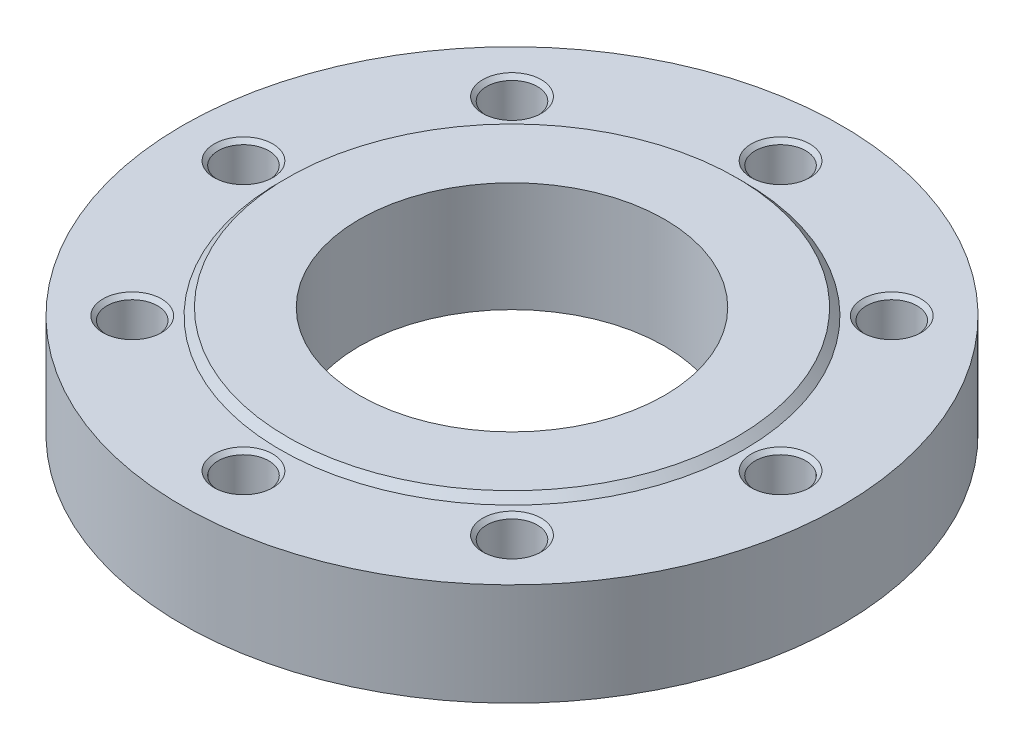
ISO-10303-21;
HEADER;
FILE_DESCRIPTION(('STEP AP214'),'2;1');
FILE_NAME('part.step','',(''),(''),'','','');
FILE_SCHEMA(('AUTOMOTIVE_DESIGN { 1 0 10303 214 1 1 1 1 }'));
ENDSEC;
DATA;
#1=APPLICATION_CONTEXT('core data for automotive mechanical design processes');
#2=APPLICATION_PROTOCOL_DEFINITION('international standard','automotive_design',2000,#1);
#3=PRODUCT_CONTEXT('',#1,'mechanical');
#4=PRODUCT('Part','Part','',(#3));
#5=PRODUCT_RELATED_PRODUCT_CATEGORY('part','',(#4));
#6=PRODUCT_DEFINITION_FORMATION('','',#4);
#7=PRODUCT_DEFINITION_CONTEXT('part definition',#1,'design');
#8=PRODUCT_DEFINITION('design','',#6,#7);
#9=PRODUCT_DEFINITION_SHAPE('','',#8);
#10=(LENGTH_UNIT() NAMED_UNIT(*) SI_UNIT(.MILLI.,.METRE.));
#11=(NAMED_UNIT(*) PLANE_ANGLE_UNIT() SI_UNIT($,.RADIAN.));
#12=(NAMED_UNIT(*) SI_UNIT($,.STERADIAN.) SOLID_ANGLE_UNIT());
#13=UNCERTAINTY_MEASURE_WITH_UNIT(LENGTH_MEASURE(1.E-05),#10,'distance_accuracy_value','');
#14=(GEOMETRIC_REPRESENTATION_CONTEXT(3) GLOBAL_UNCERTAINTY_ASSIGNED_CONTEXT((#13)) GLOBAL_UNIT_ASSIGNED_CONTEXT((#10,
#11,#12)) REPRESENTATION_CONTEXT('',''));
#15=CARTESIAN_POINT('',(0.,0.,0.));
#16=DIRECTION('',(0.,0.,1.));
#17=DIRECTION('',(1.,0.,0.));
#18=AXIS2_PLACEMENT_3D('',#15,#16,#17);
#19=CARTESIAN_POINT('',(0.,21.,0.));
#20=DIRECTION('',(0.,-1.,0.));
#21=DIRECTION('',(1.,0.,0.));
#22=AXIS2_PLACEMENT_3D('',#19,#20,#21);
#23=CYLINDRICAL_SURFACE('',#22,135.);
#24=CARTESIAN_POINT('',(0.,0.,0.));
#25=DIRECTION('',(0.,1.,0.));
#26=DIRECTION('',(1.,0.,0.));
#27=AXIS2_PLACEMENT_3D('',#24,#25,#26);
#28=CIRCLE('',#27,135.);
#29=CARTESIAN_POINT('',(135.,0.,0.));
#30=VERTEX_POINT('',#29);
#31=EDGE_CURVE('E9',#30,#30,#28,.T.);
#32=ORIENTED_EDGE('',*,*,#31,.T.);
#33=EDGE_LOOP('',(#32));
#34=FACE_BOUND('',#33,.T.);
#35=CARTESIAN_POINT('',(0.,42.,0.));
#36=DIRECTION('',(0.,1.,0.));
#37=DIRECTION('',(1.,0.,0.));
#38=AXIS2_PLACEMENT_3D('',#35,#36,#37);
#39=CIRCLE('',#38,135.);
#40=CARTESIAN_POINT('',(135.,42.,0.));
#41=VERTEX_POINT('',#40);
#42=EDGE_CURVE('E247',#41,#41,#39,.T.);
#43=ORIENTED_EDGE('',*,*,#42,.F.);
#44=EDGE_LOOP('',(#43));
#45=FACE_BOUND('',#44,.T.);
#46=ADVANCED_FACE('F15',(#34,#45),#23,.T.);
#47=CARTESIAN_POINT('',(98.75,0.,0.));
#48=DIRECTION('',(0.,-1.,0.));
#49=DIRECTION('',(-1.,0.,0.));
#50=AXIS2_PLACEMENT_3D('',#47,#48,#49);
#51=PLANE('',#50);
#52=CARTESIAN_POINT('',(0.,0.,0.));
#53=DIRECTION('',(0.,1.,0.));
#54=DIRECTION('',(1.,0.,0.));
#55=AXIS2_PLACEMENT_3D('',#52,#53,#54);
#56=CIRCLE('',#55,62.5);
#57=CARTESIAN_POINT('',(62.5,0.,0.));
#58=VERTEX_POINT('',#57);
#59=EDGE_CURVE('E22',#58,#58,#56,.T.);
#60=ORIENTED_EDGE('',*,*,#59,.T.);
#61=EDGE_LOOP('',(#60));
#62=FACE_BOUND('',#61,.T.);
#63=ORIENTED_EDGE('',*,*,#31,.F.);
#64=EDGE_LOOP('',(#63));
#65=FACE_BOUND('',#64,.T.);
#66=ADVANCED_FACE('F286',(#62,#65),#51,.T.);
#67=CARTESIAN_POINT('',(0.,22.5,0.));
#68=DIRECTION('',(0.,-1.,0.));
#69=DIRECTION('',(1.,0.,0.));
#70=AXIS2_PLACEMENT_3D('',#67,#68,#69);
#71=CYLINDRICAL_SURFACE('',#70,62.5);
#72=CARTESIAN_POINT('',(0.,45.,0.));
#73=DIRECTION('',(0.,1.,0.));
#74=DIRECTION('',(1.,0.,0.));
#75=AXIS2_PLACEMENT_3D('',#72,#73,#74);
#76=CIRCLE('',#75,62.5);
#77=CARTESIAN_POINT('',(62.5,45.,0.));
#78=VERTEX_POINT('',#77);
#79=EDGE_CURVE('E250',#78,#78,#76,.T.);
#80=ORIENTED_EDGE('',*,*,#79,.T.);
#81=EDGE_LOOP('',(#80));
#82=FACE_BOUND('',#81,.T.);
#83=ORIENTED_EDGE('',*,*,#59,.F.);
#84=EDGE_LOOP('',(#83));
#85=FACE_BOUND('',#84,.T.);
#86=ADVANCED_FACE('F290',(#82,#85),#71,.F.);
#87=CARTESIAN_POINT('',(77.25,45.,0.));
#88=DIRECTION('',(0.,1.,0.));
#89=DIRECTION('',(1.,0.,0.));
#90=AXIS2_PLACEMENT_3D('',#87,#88,#89);
#91=PLANE('',#90);
#92=CARTESIAN_POINT('',(0.,45.,0.));
#93=DIRECTION('',(0.,1.,0.));
#94=DIRECTION('',(1.,0.,0.));
#95=AXIS2_PLACEMENT_3D('',#92,#93,#94);
#96=CIRCLE('',#95,92.);
#97=CARTESIAN_POINT('',(92.,45.,0.));
#98=VERTEX_POINT('',#97);
#99=EDGE_CURVE('E249',#98,#98,#96,.T.);
#100=ORIENTED_EDGE('',*,*,#99,.T.);
#101=EDGE_LOOP('',(#100));
#102=FACE_BOUND('',#101,.T.);
#103=ORIENTED_EDGE('',*,*,#79,.F.);
#104=EDGE_LOOP('',(#103));
#105=FACE_BOUND('',#104,.T.);
#106=ADVANCED_FACE('F715',(#102,#105),#91,.T.);
#107=CARTESIAN_POINT('',(0.,43.5,0.));
#108=DIRECTION('',(0.,-1.,0.));
#109=DIRECTION('',(1.,0.,0.));
#110=AXIS2_PLACEMENT_3D('',#107,#108,#109);
#111=CONICAL_SURFACE('',#110,93.5,0.785398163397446);
#112=CARTESIAN_POINT('',(0.,42.,0.));
#113=DIRECTION('',(0.,1.,0.));
#114=DIRECTION('',(1.,0.,0.));
#115=AXIS2_PLACEMENT_3D('',#112,#113,#114);
#116=CIRCLE('',#115,95.);
#117=CARTESIAN_POINT('',(95.,42.,0.));
#118=VERTEX_POINT('',#117);
#119=EDGE_CURVE('E245',#118,#118,#116,.T.);
#120=ORIENTED_EDGE('',*,*,#119,.T.);
#121=EDGE_LOOP('',(#120));
#122=FACE_BOUND('',#121,.T.);
#123=ORIENTED_EDGE('',*,*,#99,.F.);
#124=EDGE_LOOP('',(#123));
#125=FACE_BOUND('',#124,.T.);
#126=ADVANCED_FACE('F298',(#122,#125),#111,.T.);
#127=CARTESIAN_POINT('',(115.,42.,0.));
#128=DIRECTION('',(0.,1.,0.));
#129=DIRECTION('',(1.,0.,0.));
#130=AXIS2_PLACEMENT_3D('',#127,#128,#129);
#131=PLANE('',#130);
#132=ORIENTED_EDGE('',*,*,#42,.T.);
#133=EDGE_LOOP('',(#132));
#134=FACE_BOUND('',#133,.T.);
#135=ORIENTED_EDGE('',*,*,#119,.F.);
#136=EDGE_LOOP('',(#135));
#137=FACE_BOUND('',#136,.T.);
#138=CARTESIAN_POINT('',(110.,42.,0.));
#139=DIRECTION('',(0.,-1.,0.));
#140=DIRECTION('',(1.,0.,0.));
#141=AXIS2_PLACEMENT_3D('',#138,#139,#140);
#142=CIRCLE('',#141,12.);
#143=CARTESIAN_POINT('',(122.,42.,0.));
#144=VERTEX_POINT('',#143);
#145=EDGE_CURVE('E235',#144,#144,#142,.T.);
#146=ORIENTED_EDGE('',*,*,#145,.T.);
#147=EDGE_LOOP('',(#146));
#148=FACE_BOUND('',#147,.T.);
#149=CARTESIAN_POINT('',(77.7817459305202,42.,-77.7817459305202));
#150=DIRECTION('',(0.,-1.,0.));
#151=DIRECTION('',(0.707106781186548,0.,-0.707106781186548));
#152=AXIS2_PLACEMENT_3D('',#149,#150,#151);
#153=CIRCLE('',#152,12.);
#154=CARTESIAN_POINT('',(86.2670273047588,42.,-86.2670273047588));
#155=VERTEX_POINT('',#154);
#156=EDGE_CURVE('E217',#155,#155,#153,.T.);
#157=ORIENTED_EDGE('',*,*,#156,.T.);
#158=EDGE_LOOP('',(#157));
#159=FACE_BOUND('',#158,.T.);
#160=CARTESIAN_POINT('',(0.,42.,-110.));
#161=DIRECTION('',(0.,-1.,0.));
#162=DIRECTION('',(0.,0.,-1.));
#163=AXIS2_PLACEMENT_3D('',#160,#161,#162);
#164=CIRCLE('',#163,12.);
#165=CARTESIAN_POINT('',(0.,42.,-122.));
#166=VERTEX_POINT('',#165);
#167=EDGE_CURVE('E262',#166,#166,#164,.T.);
#168=ORIENTED_EDGE('',*,*,#167,.T.);
#169=EDGE_LOOP('',(#168));
#170=FACE_BOUND('',#169,.T.);
#171=CARTESIAN_POINT('',(-77.7817459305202,42.,-77.7817459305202));
#172=DIRECTION('',(0.,-1.,0.));
#173=DIRECTION('',(-0.707106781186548,0.,-0.707106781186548));
#174=AXIS2_PLACEMENT_3D('',#171,#172,#173);
#175=CIRCLE('',#174,12.);
#176=CARTESIAN_POINT('',(-86.2670273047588,42.,-86.2670273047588));
#177=VERTEX_POINT('',#176);
#178=EDGE_CURVE('E310',#177,#177,#175,.T.);
#179=ORIENTED_EDGE('',*,*,#178,.T.);
#180=EDGE_LOOP('',(#179));
#181=FACE_BOUND('',#180,.T.);
#182=CARTESIAN_POINT('',(-110.,42.,0.));
#183=DIRECTION('',(0.,-1.,0.));
#184=DIRECTION('',(-1.,0.,0.));
#185=AXIS2_PLACEMENT_3D('',#182,#183,#184);
#186=CIRCLE('',#185,12.);
#187=CARTESIAN_POINT('',(-122.,42.,0.));
#188=VERTEX_POINT('',#187);
#189=EDGE_CURVE('E313',#188,#188,#186,.T.);
#190=ORIENTED_EDGE('',*,*,#189,.T.);
#191=EDGE_LOOP('',(#190));
#192=FACE_BOUND('',#191,.T.);
#193=CARTESIAN_POINT('',(-77.7817459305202,42.,77.7817459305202));
#194=DIRECTION('',(0.,-1.,0.));
#195=DIRECTION('',(-0.707106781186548,0.,0.707106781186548));
#196=AXIS2_PLACEMENT_3D('',#193,#194,#195);
#197=CIRCLE('',#196,12.);
#198=CARTESIAN_POINT('',(-86.2670273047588,42.,86.2670273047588));
#199=VERTEX_POINT('',#198);
#200=EDGE_CURVE('E316',#199,#199,#197,.T.);
#201=ORIENTED_EDGE('',*,*,#200,.T.);
#202=EDGE_LOOP('',(#201));
#203=FACE_BOUND('',#202,.T.);
#204=CARTESIAN_POINT('',(0.,42.,110.));
#205=DIRECTION('',(0.,-1.,0.));
#206=DIRECTION('',(0.,0.,1.));
#207=AXIS2_PLACEMENT_3D('',#204,#205,#206);
#208=CIRCLE('',#207,12.);
#209=CARTESIAN_POINT('',(0.,42.,122.));
#210=VERTEX_POINT('',#209);
#211=EDGE_CURVE('E319',#210,#210,#208,.T.);
#212=ORIENTED_EDGE('',*,*,#211,.T.);
#213=EDGE_LOOP('',(#212));
#214=FACE_BOUND('',#213,.T.);
#215=CARTESIAN_POINT('',(77.7817459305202,42.,77.7817459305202));
#216=DIRECTION('',(0.,-1.,0.));
#217=DIRECTION('',(0.707106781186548,0.,0.707106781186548));
#218=AXIS2_PLACEMENT_3D('',#215,#216,#217);
#219=CIRCLE('',#218,12.);
#220=CARTESIAN_POINT('',(86.2670273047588,42.,86.2670273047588));
#221=VERTEX_POINT('',#220);
#222=EDGE_CURVE('E321',#221,#221,#219,.T.);
#223=ORIENTED_EDGE('',*,*,#222,.T.);
#224=EDGE_LOOP('',(#223));
#225=FACE_BOUND('',#224,.T.);
#226=ADVANCED_FACE('F294',(#134,#137,#148,#159,#170,#181,#192,#203,#214,#225),#131,.T.);
#227=CARTESIAN_POINT('',(110.,6.00463463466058,0.));
#228=DIRECTION('',(0.,1.,0.));
#229=DIRECTION('',(1.,0.,0.));
#230=AXIS2_PLACEMENT_3D('',#227,#228,#229);
#231=CONICAL_SURFACE('',#230,5.188125,1.0471975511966);
#232=CARTESIAN_POINT('',(110.,9.,0.));
#233=DIRECTION('',(0.,-1.,0.));
#234=DIRECTION('',(1.,0.,0.));
#235=AXIS2_PLACEMENT_3D('',#232,#233,#234);
#236=CIRCLE('',#235,10.37625);
#237=CARTESIAN_POINT('',(120.37625,9.,0.));
#238=VERTEX_POINT('',#237);
#239=EDGE_CURVE('E243',#238,#238,#236,.T.);
#240=ORIENTED_EDGE('',*,*,#239,.F.);
#241=EDGE_LOOP('',(#240));
#242=FACE_BOUND('',#241,.T.);
#243=CARTESIAN_POINT('',(110.,3.00926926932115,0.));
#244=VERTEX_POINT('',#243);
#245=VERTEX_LOOP('',#244);
#246=FACE_BOUND('',#245,.T.);
#247=ADVANCED_FACE('F297',(#242,#246),#231,.F.);
#248=CARTESIAN_POINT('',(110.,12.688125,0.));
#249=DIRECTION('',(0.,1.,0.));
#250=DIRECTION('',(1.,0.,0.));
#251=AXIS2_PLACEMENT_3D('',#248,#249,#250);
#252=CYLINDRICAL_SURFACE('',#251,10.37625);
#253=CARTESIAN_POINT('',(110.,16.37625,0.));
#254=DIRECTION('',(0.,-1.,0.));
#255=DIRECTION('',(1.,0.,0.));
#256=AXIS2_PLACEMENT_3D('',#253,#254,#255);
#257=CIRCLE('',#256,10.37625);
#258=CARTESIAN_POINT('',(120.37625,16.37625,0.));
#259=VERTEX_POINT('',#258);
#260=EDGE_CURVE('E241',#259,#259,#257,.T.);
#261=ORIENTED_EDGE('',*,*,#260,.F.);
#262=EDGE_LOOP('',(#261));
#263=FACE_BOUND('',#262,.T.);
#264=ORIENTED_EDGE('',*,*,#239,.T.);
#265=EDGE_LOOP('',(#264));
#266=FACE_BOUND('',#265,.T.);
#267=ADVANCED_FACE('F731',(#263,#266),#252,.F.);
#268=CARTESIAN_POINT('',(110.,17.188125,0.));
#269=DIRECTION('',(0.,1.,0.));
#270=DIRECTION('',(1.,0.,0.));
#271=AXIS2_PLACEMENT_3D('',#268,#269,#270);
#272=CONICAL_SURFACE('',#271,11.188125,0.785398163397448);
#273=CARTESIAN_POINT('',(110.,18.,0.));
#274=DIRECTION('',(0.,-1.,0.));
#275=DIRECTION('',(1.,0.,0.));
#276=AXIS2_PLACEMENT_3D('',#273,#274,#275);
#277=CIRCLE('',#276,12.);
#278=CARTESIAN_POINT('',(122.,18.,0.));
#279=VERTEX_POINT('',#278);
#280=EDGE_CURVE('E239',#279,#279,#277,.T.);
#281=ORIENTED_EDGE('',*,*,#280,.F.);
#282=EDGE_LOOP('',(#281));
#283=FACE_BOUND('',#282,.T.);
#284=ORIENTED_EDGE('',*,*,#260,.T.);
#285=EDGE_LOOP('',(#284));
#286=FACE_BOUND('',#285,.T.);
#287=ADVANCED_FACE('F735',(#283,#286),#272,.F.);
#288=CARTESIAN_POINT('',(121.188125,18.,0.));
#289=DIRECTION('',(0.,1.,0.));
#290=DIRECTION('',(-1.,0.,0.));
#291=AXIS2_PLACEMENT_3D('',#288,#289,#290);
#292=PLANE('',#291);
#293=CARTESIAN_POINT('',(110.,18.,0.));
#294=DIRECTION('',(0.,-1.,0.));
#295=DIRECTION('',(1.,0.,0.));
#296=AXIS2_PLACEMENT_3D('',#293,#294,#295);
#297=CIRCLE('',#296,10.37625);
#298=CARTESIAN_POINT('',(120.37625,18.,0.));
#299=VERTEX_POINT('',#298);
#300=EDGE_CURVE('E237',#299,#299,#297,.T.);
#301=ORIENTED_EDGE('',*,*,#300,.F.);
#302=EDGE_LOOP('',(#301));
#303=FACE_BOUND('',#302,.T.);
#304=ORIENTED_EDGE('',*,*,#280,.T.);
#305=EDGE_LOOP('',(#304));
#306=FACE_BOUND('',#305,.T.);
#307=ADVANCED_FACE('F739',(#303,#306),#292,.F.);
#308=CARTESIAN_POINT('',(110.,29.188125,0.));
#309=DIRECTION('',(0.,1.,0.));
#310=DIRECTION('',(1.,0.,0.));
#311=AXIS2_PLACEMENT_3D('',#308,#309,#310);
#312=CYLINDRICAL_SURFACE('',#311,10.37625);
#313=CARTESIAN_POINT('',(110.,40.37625,0.));
#314=DIRECTION('',(0.,-1.,0.));
#315=DIRECTION('',(1.,0.,0.));
#316=AXIS2_PLACEMENT_3D('',#313,#314,#315);
#317=CIRCLE('',#316,10.37625);
#318=CARTESIAN_POINT('',(120.37625,40.37625,0.));
#319=VERTEX_POINT('',#318);
#320=EDGE_CURVE('E233',#319,#319,#317,.T.);
#321=ORIENTED_EDGE('',*,*,#320,.F.);
#322=EDGE_LOOP('',(#321));
#323=FACE_BOUND('',#322,.T.);
#324=ORIENTED_EDGE('',*,*,#300,.T.);
#325=EDGE_LOOP('',(#324));
#326=FACE_BOUND('',#325,.T.);
#327=ADVANCED_FACE('F743',(#323,#326),#312,.F.);
#328=CARTESIAN_POINT('',(110.,41.188125,0.));
#329=DIRECTION('',(0.,1.,0.));
#330=DIRECTION('',(1.,0.,0.));
#331=AXIS2_PLACEMENT_3D('',#328,#329,#330);
#332=CONICAL_SURFACE('',#331,11.188125,0.785398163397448);
#333=ORIENTED_EDGE('',*,*,#145,.F.);
#334=EDGE_LOOP('',(#333));
#335=FACE_BOUND('',#334,.T.);
#336=ORIENTED_EDGE('',*,*,#320,.T.);
#337=EDGE_LOOP('',(#336));
#338=FACE_BOUND('',#337,.T.);
#339=ADVANCED_FACE('F747',(#335,#338),#332,.F.);
#340=CARTESIAN_POINT('',(77.7817459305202,6.00463463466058,-77.7817459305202));
#341=DIRECTION('',(0.,1.,0.));
#342=DIRECTION('',(0.707106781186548,0.,-0.707106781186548));
#343=AXIS2_PLACEMENT_3D('',#340,#341,#342);
#344=CONICAL_SURFACE('',#343,5.188125,1.0471975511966);
#345=CARTESIAN_POINT('',(77.7817459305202,9.,-77.7817459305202));
#346=DIRECTION('',(0.,-1.,0.));
#347=DIRECTION('',(0.707106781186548,0.,-0.707106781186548));
#348=AXIS2_PLACEMENT_3D('',#345,#346,#347);
#349=CIRCLE('',#348,10.37625);
#350=CARTESIAN_POINT('',(85.1188626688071,9.,-85.1188626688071));
#351=VERTEX_POINT('',#350);
#352=EDGE_CURVE('E231',#351,#351,#349,.T.);
#353=ORIENTED_EDGE('',*,*,#352,.F.);
#354=EDGE_LOOP('',(#353));
#355=FACE_BOUND('',#354,.T.);
#356=CARTESIAN_POINT('',(77.7817459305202,3.00926926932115,-77.7817459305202));
#357=VERTEX_POINT('',#356);
#358=VERTEX_LOOP('',#357);
#359=FACE_BOUND('',#358,.T.);
#360=ADVANCED_FACE('F751',(#355,#359),#344,.F.);
#361=CARTESIAN_POINT('',(77.7817459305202,12.688125,-77.7817459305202));
#362=DIRECTION('',(0.,1.,0.));
#363=DIRECTION('',(0.707106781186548,0.,-0.707106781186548));
#364=AXIS2_PLACEMENT_3D('',#361,#362,#363);
#365=CYLINDRICAL_SURFACE('',#364,10.37625);
#366=CARTESIAN_POINT('',(77.7817459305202,16.37625,-77.7817459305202));
#367=DIRECTION('',(0.,-1.,0.));
#368=DIRECTION('',(0.707106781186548,0.,-0.707106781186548));
#369=AXIS2_PLACEMENT_3D('',#366,#367,#368);
#370=CIRCLE('',#369,10.37625);
#371=CARTESIAN_POINT('',(85.1188626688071,16.37625,-85.1188626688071));
#372=VERTEX_POINT('',#371);
#373=EDGE_CURVE('E229',#372,#372,#370,.T.);
#374=ORIENTED_EDGE('',*,*,#373,.F.);
#375=EDGE_LOOP('',(#374));
#376=FACE_BOUND('',#375,.T.);
#377=ORIENTED_EDGE('',*,*,#352,.T.);
#378=EDGE_LOOP('',(#377));
#379=FACE_BOUND('',#378,.T.);
#380=ADVANCED_FACE('F755',(#376,#379),#365,.F.);
#381=CARTESIAN_POINT('',(77.7817459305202,17.188125,-77.7817459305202));
#382=DIRECTION('',(0.,1.,0.));
#383=DIRECTION('',(0.707106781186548,0.,-0.707106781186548));
#384=AXIS2_PLACEMENT_3D('',#381,#382,#383);
#385=CONICAL_SURFACE('',#384,11.188125,0.785398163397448);
#386=CARTESIAN_POINT('',(77.7817459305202,18.,-77.7817459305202));
#387=DIRECTION('',(0.,-1.,0.));
#388=DIRECTION('',(0.707106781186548,0.,-0.707106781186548));
#389=AXIS2_PLACEMENT_3D('',#386,#387,#388);
#390=CIRCLE('',#389,12.);
#391=CARTESIAN_POINT('',(86.2670273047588,18.,-86.2670273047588));
#392=VERTEX_POINT('',#391);
#393=EDGE_CURVE('E227',#392,#392,#390,.T.);
#394=ORIENTED_EDGE('',*,*,#393,.F.);
#395=EDGE_LOOP('',(#394));
#396=FACE_BOUND('',#395,.T.);
#397=ORIENTED_EDGE('',*,*,#373,.T.);
#398=EDGE_LOOP('',(#397));
#399=FACE_BOUND('',#398,.T.);
#400=ADVANCED_FACE('F759',(#396,#399),#385,.F.);
#401=CARTESIAN_POINT('',(85.692944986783,18.,-85.692944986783));
#402=DIRECTION('',(0.,1.,0.));
#403=DIRECTION('',(-0.707106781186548,0.,0.707106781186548));
#404=AXIS2_PLACEMENT_3D('',#401,#402,#403);
#405=PLANE('',#404);
#406=CARTESIAN_POINT('',(77.7817459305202,18.,-77.7817459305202));
#407=DIRECTION('',(0.,-1.,0.));
#408=DIRECTION('',(0.707106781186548,0.,-0.707106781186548));
#409=AXIS2_PLACEMENT_3D('',#406,#407,#408);
#410=CIRCLE('',#409,10.37625);
#411=CARTESIAN_POINT('',(85.1188626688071,18.,-85.1188626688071));
#412=VERTEX_POINT('',#411);
#413=EDGE_CURVE('E225',#412,#412,#410,.T.);
#414=ORIENTED_EDGE('',*,*,#413,.F.);
#415=EDGE_LOOP('',(#414));
#416=FACE_BOUND('',#415,.T.);
#417=ORIENTED_EDGE('',*,*,#393,.T.);
#418=EDGE_LOOP('',(#417));
#419=FACE_BOUND('',#418,.T.);
#420=ADVANCED_FACE('F763',(#416,#419),#405,.F.);
#421=CARTESIAN_POINT('',(77.7817459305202,29.188125,-77.7817459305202));
#422=DIRECTION('',(0.,1.,0.));
#423=DIRECTION('',(0.707106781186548,0.,-0.707106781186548));
#424=AXIS2_PLACEMENT_3D('',#421,#422,#423);
#425=CYLINDRICAL_SURFACE('',#424,10.37625);
#426=CARTESIAN_POINT('',(77.7817459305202,40.37625,-77.7817459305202));
#427=DIRECTION('',(0.,-1.,0.));
#428=DIRECTION('',(0.707106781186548,0.,-0.707106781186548));
#429=AXIS2_PLACEMENT_3D('',#426,#427,#428);
#430=CIRCLE('',#429,10.37625);
#431=CARTESIAN_POINT('',(85.1188626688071,40.37625,-85.1188626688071));
#432=VERTEX_POINT('',#431);
#433=EDGE_CURVE('E214',#432,#432,#430,.T.);
#434=ORIENTED_EDGE('',*,*,#433,.F.);
#435=EDGE_LOOP('',(#434));
#436=FACE_BOUND('',#435,.T.);
#437=ORIENTED_EDGE('',*,*,#413,.T.);
#438=EDGE_LOOP('',(#437));
#439=FACE_BOUND('',#438,.T.);
#440=ADVANCED_FACE('F767',(#436,#439),#425,.F.);
#441=CARTESIAN_POINT('',(77.7817459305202,41.188125,-77.7817459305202));
#442=DIRECTION('',(0.,1.,0.));
#443=DIRECTION('',(0.707106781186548,0.,-0.707106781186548));
#444=AXIS2_PLACEMENT_3D('',#441,#442,#443);
#445=CONICAL_SURFACE('',#444,11.188125,0.785398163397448);
#446=ORIENTED_EDGE('',*,*,#156,.F.);
#447=EDGE_LOOP('',(#446));
#448=FACE_BOUND('',#447,.T.);
#449=ORIENTED_EDGE('',*,*,#433,.T.);
#450=EDGE_LOOP('',(#449));
#451=FACE_BOUND('',#450,.T.);
#452=ADVANCED_FACE('F283',(#448,#451),#445,.F.);
#453=CARTESIAN_POINT('',(0.,6.00463463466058,-110.));
#454=DIRECTION('',(0.,1.,0.));
#455=DIRECTION('',(0.,0.,-1.));
#456=AXIS2_PLACEMENT_3D('',#453,#454,#455);
#457=CONICAL_SURFACE('',#456,5.188125,1.0471975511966);
#458=CARTESIAN_POINT('',(0.,9.,-110.));
#459=DIRECTION('',(0.,-1.,0.));
#460=DIRECTION('',(0.,0.,-1.));
#461=AXIS2_PLACEMENT_3D('',#458,#459,#460);
#462=CIRCLE('',#461,10.37625);
#463=CARTESIAN_POINT('',(0.,9.,-120.37625));
#464=VERTEX_POINT('',#463);
#465=EDGE_CURVE('E211',#464,#464,#462,.T.);
#466=ORIENTED_EDGE('',*,*,#465,.F.);
#467=EDGE_LOOP('',(#466));
#468=FACE_BOUND('',#467,.T.);
#469=CARTESIAN_POINT('',(0.,3.00926926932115,-110.));
#470=VERTEX_POINT('',#469);
#471=VERTEX_LOOP('',#470);
#472=FACE_BOUND('',#471,.T.);
#473=ADVANCED_FACE('F277',(#468,#472),#457,.F.);
#474=CARTESIAN_POINT('',(0.,12.688125,-110.));
#475=DIRECTION('',(0.,1.,0.));
#476=DIRECTION('',(0.,0.,-1.));
#477=AXIS2_PLACEMENT_3D('',#474,#475,#476);
#478=CYLINDRICAL_SURFACE('',#477,10.37625);
#479=CARTESIAN_POINT('',(0.,16.37625,-110.));
#480=DIRECTION('',(0.,-1.,0.));
#481=DIRECTION('',(0.,0.,-1.));
#482=AXIS2_PLACEMENT_3D('',#479,#480,#481);
#483=CIRCLE('',#482,10.37625);
#484=CARTESIAN_POINT('',(0.,16.37625,-120.37625));
#485=VERTEX_POINT('',#484);
#486=EDGE_CURVE('E215',#485,#485,#483,.T.);
#487=ORIENTED_EDGE('',*,*,#486,.F.);
#488=EDGE_LOOP('',(#487));
#489=FACE_BOUND('',#488,.T.);
#490=ORIENTED_EDGE('',*,*,#465,.T.);
#491=EDGE_LOOP('',(#490));
#492=FACE_BOUND('',#491,.T.);
#493=ADVANCED_FACE('F212',(#489,#492),#478,.F.);
#494=CARTESIAN_POINT('',(0.,17.188125,-110.));
#495=DIRECTION('',(0.,1.,0.));
#496=DIRECTION('',(0.,0.,-1.));
#497=AXIS2_PLACEMENT_3D('',#494,#495,#496);
#498=CONICAL_SURFACE('',#497,11.188125,0.785398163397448);
#499=CARTESIAN_POINT('',(0.,18.,-110.));
#500=DIRECTION('',(0.,-1.,0.));
#501=DIRECTION('',(0.,0.,-1.));
#502=AXIS2_PLACEMENT_3D('',#499,#500,#501);
#503=CIRCLE('',#502,12.);
#504=CARTESIAN_POINT('',(0.,18.,-122.));
#505=VERTEX_POINT('',#504);
#506=EDGE_CURVE('E219',#505,#505,#503,.T.);
#507=ORIENTED_EDGE('',*,*,#506,.F.);
#508=EDGE_LOOP('',(#507));
#509=FACE_BOUND('',#508,.T.);
#510=ORIENTED_EDGE('',*,*,#486,.T.);
#511=EDGE_LOOP('',(#510));
#512=FACE_BOUND('',#511,.T.);
#513=ADVANCED_FACE('F270',(#509,#512),#498,.F.);
#514=CARTESIAN_POINT('',(0.,18.,-121.188125));
#515=DIRECTION('',(0.,1.,0.));
#516=DIRECTION('',(0.,0.,1.));
#517=AXIS2_PLACEMENT_3D('',#514,#515,#516);
#518=PLANE('',#517);
#519=CARTESIAN_POINT('',(0.,18.,-110.));
#520=DIRECTION('',(0.,-1.,0.));
#521=DIRECTION('',(0.,0.,-1.));
#522=AXIS2_PLACEMENT_3D('',#519,#520,#521);
#523=CIRCLE('',#522,10.37625);
#524=CARTESIAN_POINT('',(0.,18.,-120.37625));
#525=VERTEX_POINT('',#524);
#526=EDGE_CURVE('E263',#525,#525,#523,.T.);
#527=ORIENTED_EDGE('',*,*,#526,.F.);
#528=EDGE_LOOP('',(#527));
#529=FACE_BOUND('',#528,.T.);
#530=ORIENTED_EDGE('',*,*,#506,.T.);
#531=EDGE_LOOP('',(#530));
#532=FACE_BOUND('',#531,.T.);
#533=ADVANCED_FACE('F268',(#529,#532),#518,.F.);
#534=CARTESIAN_POINT('',(0.,29.188125,-110.));
#535=DIRECTION('',(0.,1.,0.));
#536=DIRECTION('',(0.,0.,-1.));
#537=AXIS2_PLACEMENT_3D('',#534,#535,#536);
#538=CYLINDRICAL_SURFACE('',#537,10.37625);
#539=CARTESIAN_POINT('',(0.,40.37625,-110.));
#540=DIRECTION('',(0.,-1.,0.));
#541=DIRECTION('',(0.,0.,-1.));
#542=AXIS2_PLACEMENT_3D('',#539,#540,#541);
#543=CIRCLE('',#542,10.37625);
#544=CARTESIAN_POINT('',(0.,40.37625,-120.37625));
#545=VERTEX_POINT('',#544);
#546=EDGE_CURVE('E260',#545,#545,#543,.T.);
#547=ORIENTED_EDGE('',*,*,#546,.F.);
#548=EDGE_LOOP('',(#547));
#549=FACE_BOUND('',#548,.T.);
#550=ORIENTED_EDGE('',*,*,#526,.T.);
#551=EDGE_LOOP('',(#550));
#552=FACE_BOUND('',#551,.T.);
#553=ADVANCED_FACE('F392',(#549,#552),#538,.F.);
#554=CARTESIAN_POINT('',(0.,41.188125,-110.));
#555=DIRECTION('',(0.,1.,0.));
#556=DIRECTION('',(0.,0.,-1.));
#557=AXIS2_PLACEMENT_3D('',#554,#555,#556);
#558=CONICAL_SURFACE('',#557,11.188125,0.785398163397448);
#559=ORIENTED_EDGE('',*,*,#167,.F.);
#560=EDGE_LOOP('',(#559));
#561=FACE_BOUND('',#560,.T.);
#562=ORIENTED_EDGE('',*,*,#546,.T.);
#563=EDGE_LOOP('',(#562));
#564=FACE_BOUND('',#563,.T.);
#565=ADVANCED_FACE('F387',(#561,#564),#558,.F.);
#566=CARTESIAN_POINT('',(-77.7817459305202,6.00463463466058,-77.7817459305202));
#567=DIRECTION('',(0.,1.,0.));
#568=DIRECTION('',(-0.707106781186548,0.,-0.707106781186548));
#569=AXIS2_PLACEMENT_3D('',#566,#567,#568);
#570=CONICAL_SURFACE('',#569,5.188125,1.0471975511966);
#571=CARTESIAN_POINT('',(-77.7817459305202,9.,-77.7817459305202));
#572=DIRECTION('',(0.,-1.,0.));
#573=DIRECTION('',(-0.707106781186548,0.,-0.707106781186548));
#574=AXIS2_PLACEMENT_3D('',#571,#572,#573);
#575=CIRCLE('',#574,10.37625);
#576=CARTESIAN_POINT('',(-85.1188626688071,9.,-85.1188626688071));
#577=VERTEX_POINT('',#576);
#578=EDGE_CURVE('E258',#577,#577,#575,.T.);
#579=ORIENTED_EDGE('',*,*,#578,.F.);
#580=EDGE_LOOP('',(#579));
#581=FACE_BOUND('',#580,.T.);
#582=CARTESIAN_POINT('',(-77.7817459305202,3.00926926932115,-77.7817459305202));
#583=VERTEX_POINT('',#582);
#584=VERTEX_LOOP('',#583);
#585=FACE_BOUND('',#584,.T.);
#586=ADVANCED_FACE('F381',(#581,#585),#570,.F.);
#587=CARTESIAN_POINT('',(-77.7817459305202,12.688125,-77.7817459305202));
#588=DIRECTION('',(0.,1.,0.));
#589=DIRECTION('',(-0.707106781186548,0.,-0.707106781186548));
#590=AXIS2_PLACEMENT_3D('',#587,#588,#589);
#591=CYLINDRICAL_SURFACE('',#590,10.37625);
#592=CARTESIAN_POINT('',(-77.7817459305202,16.37625,-77.7817459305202));
#593=DIRECTION('',(0.,-1.,0.));
#594=DIRECTION('',(-0.707106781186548,0.,-0.707106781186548));
#595=AXIS2_PLACEMENT_3D('',#592,#593,#594);
#596=CIRCLE('',#595,10.37625);
#597=CARTESIAN_POINT('',(-85.1188626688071,16.37625,-85.1188626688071));
#598=VERTEX_POINT('',#597);
#599=EDGE_CURVE('E256',#598,#598,#596,.T.);
#600=ORIENTED_EDGE('',*,*,#599,.F.);
#601=EDGE_LOOP('',(#600));
#602=FACE_BOUND('',#601,.T.);
#603=ORIENTED_EDGE('',*,*,#578,.T.);
#604=EDGE_LOOP('',(#603));
#605=FACE_BOUND('',#604,.T.);
#606=ADVANCED_FACE('F378',(#602,#605),#591,.F.);
#607=CARTESIAN_POINT('',(-77.7817459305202,17.188125,-77.7817459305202));
#608=DIRECTION('',(0.,1.,0.));
#609=DIRECTION('',(-0.707106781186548,0.,-0.707106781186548));
#610=AXIS2_PLACEMENT_3D('',#607,#608,#609);
#611=CONICAL_SURFACE('',#610,11.188125,0.785398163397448);
#612=CARTESIAN_POINT('',(-77.7817459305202,18.,-77.7817459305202));
#613=DIRECTION('',(0.,-1.,0.));
#614=DIRECTION('',(-0.707106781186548,0.,-0.707106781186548));
#615=AXIS2_PLACEMENT_3D('',#612,#613,#614);
#616=CIRCLE('',#615,12.);
#617=CARTESIAN_POINT('',(-86.2670273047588,18.,-86.2670273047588));
#618=VERTEX_POINT('',#617);
#619=EDGE_CURVE('E371',#618,#618,#616,.T.);
#620=ORIENTED_EDGE('',*,*,#619,.F.);
#621=EDGE_LOOP('',(#620));
#622=FACE_BOUND('',#621,.T.);
#623=ORIENTED_EDGE('',*,*,#599,.T.);
#624=EDGE_LOOP('',(#623));
#625=FACE_BOUND('',#624,.T.);
#626=ADVANCED_FACE('F376',(#622,#625),#611,.F.);
#627=CARTESIAN_POINT('',(-85.692944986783,18.,-85.692944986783));
#628=DIRECTION('',(0.,1.,0.));
#629=DIRECTION('',(0.707106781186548,0.,0.707106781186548));
#630=AXIS2_PLACEMENT_3D('',#627,#628,#629);
#631=PLANE('',#630);
#632=CARTESIAN_POINT('',(-77.7817459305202,18.,-77.7817459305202));
#633=DIRECTION('',(0.,-1.,0.));
#634=DIRECTION('',(-0.707106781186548,0.,-0.707106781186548));
#635=AXIS2_PLACEMENT_3D('',#632,#633,#634);
#636=CIRCLE('',#635,10.37625);
#637=CARTESIAN_POINT('',(-85.1188626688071,18.,-85.1188626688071));
#638=VERTEX_POINT('',#637);
#639=EDGE_CURVE('E370',#638,#638,#636,.T.);
#640=ORIENTED_EDGE('',*,*,#639,.F.);
#641=EDGE_LOOP('',(#640));
#642=FACE_BOUND('',#641,.T.);
#643=ORIENTED_EDGE('',*,*,#619,.T.);
#644=EDGE_LOOP('',(#643));
#645=FACE_BOUND('',#644,.T.);
#646=ADVANCED_FACE('F449',(#642,#645),#631,.F.);
#647=CARTESIAN_POINT('',(-77.7817459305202,29.188125,-77.7817459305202));
#648=DIRECTION('',(0.,1.,0.));
#649=DIRECTION('',(-0.707106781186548,0.,-0.707106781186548));
#650=AXIS2_PLACEMENT_3D('',#647,#648,#649);
#651=CYLINDRICAL_SURFACE('',#650,10.37625);
#652=CARTESIAN_POINT('',(-77.7817459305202,40.37625,-77.7817459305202));
#653=DIRECTION('',(0.,-1.,0.));
#654=DIRECTION('',(-0.707106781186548,0.,-0.707106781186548));
#655=AXIS2_PLACEMENT_3D('',#652,#653,#654);
#656=CIRCLE('',#655,10.37625);
#657=CARTESIAN_POINT('',(-85.1188626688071,40.37625,-85.1188626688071));
#658=VERTEX_POINT('',#657);
#659=EDGE_CURVE('E367',#658,#658,#656,.T.);
#660=ORIENTED_EDGE('',*,*,#659,.F.);
#661=EDGE_LOOP('',(#660));
#662=FACE_BOUND('',#661,.T.);
#663=ORIENTED_EDGE('',*,*,#639,.T.);
#664=EDGE_LOOP('',(#663));
#665=FACE_BOUND('',#664,.T.);
#666=ADVANCED_FACE('F452',(#662,#665),#651,.F.);
#667=CARTESIAN_POINT('',(-77.7817459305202,41.188125,-77.7817459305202));
#668=DIRECTION('',(0.,1.,0.));
#669=DIRECTION('',(-0.707106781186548,0.,-0.707106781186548));
#670=AXIS2_PLACEMENT_3D('',#667,#668,#669);
#671=CONICAL_SURFACE('',#670,11.188125,0.785398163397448);
#672=ORIENTED_EDGE('',*,*,#178,.F.);
#673=EDGE_LOOP('',(#672));
#674=FACE_BOUND('',#673,.T.);
#675=ORIENTED_EDGE('',*,*,#659,.T.);
#676=EDGE_LOOP('',(#675));
#677=FACE_BOUND('',#676,.T.);
#678=ADVANCED_FACE('F482',(#674,#677),#671,.F.);
#679=CARTESIAN_POINT('',(-110.,6.00463463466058,0.));
#680=DIRECTION('',(0.,1.,0.));
#681=DIRECTION('',(-1.,0.,0.));
#682=AXIS2_PLACEMENT_3D('',#679,#680,#681);
#683=CONICAL_SURFACE('',#682,5.188125,1.0471975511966);
#684=CARTESIAN_POINT('',(-110.,9.,0.));
#685=DIRECTION('',(0.,-1.,0.));
#686=DIRECTION('',(-1.,0.,0.));
#687=AXIS2_PLACEMENT_3D('',#684,#685,#686);
#688=CIRCLE('',#687,10.37625);
#689=CARTESIAN_POINT('',(-120.37625,9.,0.));
#690=VERTEX_POINT('',#689);
#691=EDGE_CURVE('E365',#690,#690,#688,.T.);
#692=ORIENTED_EDGE('',*,*,#691,.F.);
#693=EDGE_LOOP('',(#692));
#694=FACE_BOUND('',#693,.T.);
#695=CARTESIAN_POINT('',(-110.,3.00926926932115,0.));
#696=VERTEX_POINT('',#695);
#697=VERTEX_LOOP('',#696);
#698=FACE_BOUND('',#697,.T.);
#699=ADVANCED_FACE('F478',(#694,#698),#683,.F.);
#700=CARTESIAN_POINT('',(-110.,12.688125,0.));
#701=DIRECTION('',(0.,1.,0.));
#702=DIRECTION('',(-1.,0.,0.));
#703=AXIS2_PLACEMENT_3D('',#700,#701,#702);
#704=CYLINDRICAL_SURFACE('',#703,10.37625);
#705=CARTESIAN_POINT('',(-110.,16.37625,0.));
#706=DIRECTION('',(0.,-1.,0.));
#707=DIRECTION('',(-1.,0.,0.));
#708=AXIS2_PLACEMENT_3D('',#705,#706,#707);
#709=CIRCLE('',#708,10.37625);
#710=CARTESIAN_POINT('',(-120.37625,16.37625,0.));
#711=VERTEX_POINT('',#710);
#712=EDGE_CURVE('E363',#711,#711,#709,.T.);
#713=ORIENTED_EDGE('',*,*,#712,.F.);
#714=EDGE_LOOP('',(#713));
#715=FACE_BOUND('',#714,.T.);
#716=ORIENTED_EDGE('',*,*,#691,.T.);
#717=EDGE_LOOP('',(#716));
#718=FACE_BOUND('',#717,.T.);
#719=ADVANCED_FACE('F474',(#715,#718),#704,.F.);
#720=CARTESIAN_POINT('',(-110.,17.188125,0.));
#721=DIRECTION('',(0.,1.,0.));
#722=DIRECTION('',(-1.,0.,0.));
#723=AXIS2_PLACEMENT_3D('',#720,#721,#722);
#724=CONICAL_SURFACE('',#723,11.188125,0.785398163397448);
#725=CARTESIAN_POINT('',(-110.,18.,0.));
#726=DIRECTION('',(0.,-1.,0.));
#727=DIRECTION('',(-1.,0.,0.));
#728=AXIS2_PLACEMENT_3D('',#725,#726,#727);
#729=CIRCLE('',#728,12.);
#730=CARTESIAN_POINT('',(-122.,18.,0.));
#731=VERTEX_POINT('',#730);
#732=EDGE_CURVE('E333',#731,#731,#729,.T.);
#733=ORIENTED_EDGE('',*,*,#732,.F.);
#734=EDGE_LOOP('',(#733));
#735=FACE_BOUND('',#734,.T.);
#736=ORIENTED_EDGE('',*,*,#712,.T.);
#737=EDGE_LOOP('',(#736));
#738=FACE_BOUND('',#737,.T.);
#739=ADVANCED_FACE('F409',(#735,#738),#724,.F.);
#740=CARTESIAN_POINT('',(-121.188125,18.,0.));
#741=DIRECTION('',(0.,1.,0.));
#742=DIRECTION('',(1.,0.,0.));
#743=AXIS2_PLACEMENT_3D('',#740,#741,#742);
#744=PLANE('',#743);
#745=CARTESIAN_POINT('',(-110.,18.,0.));
#746=DIRECTION('',(0.,-1.,0.));
#747=DIRECTION('',(-1.,0.,0.));
#748=AXIS2_PLACEMENT_3D('',#745,#746,#747);
#749=CIRCLE('',#748,10.37625);
#750=CARTESIAN_POINT('',(-120.37625,18.,0.));
#751=VERTEX_POINT('',#750);
#752=EDGE_CURVE('E331',#751,#751,#749,.T.);
#753=ORIENTED_EDGE('',*,*,#752,.F.);
#754=EDGE_LOOP('',(#753));
#755=FACE_BOUND('',#754,.T.);
#756=ORIENTED_EDGE('',*,*,#732,.T.);
#757=EDGE_LOOP('',(#756));
#758=FACE_BOUND('',#757,.T.);
#759=ADVANCED_FACE('F405',(#755,#758),#744,.F.);
#760=CARTESIAN_POINT('',(-110.,29.188125,0.));
#761=DIRECTION('',(0.,1.,0.));
#762=DIRECTION('',(-1.,0.,0.));
#763=AXIS2_PLACEMENT_3D('',#760,#761,#762);
#764=CYLINDRICAL_SURFACE('',#763,10.37625);
#765=CARTESIAN_POINT('',(-110.,40.37625,0.));
#766=DIRECTION('',(0.,-1.,0.));
#767=DIRECTION('',(-1.,0.,0.));
#768=AXIS2_PLACEMENT_3D('',#765,#766,#767);
#769=CIRCLE('',#768,10.37625);
#770=CARTESIAN_POINT('',(-120.37625,40.37625,0.));
#771=VERTEX_POINT('',#770);
#772=EDGE_CURVE('E359',#771,#771,#769,.T.);
#773=ORIENTED_EDGE('',*,*,#772,.F.);
#774=EDGE_LOOP('',(#773));
#775=FACE_BOUND('',#774,.T.);
#776=ORIENTED_EDGE('',*,*,#752,.T.);
#777=EDGE_LOOP('',(#776));
#778=FACE_BOUND('',#777,.T.);
#779=ADVANCED_FACE('F408',(#775,#778),#764,.F.);
#780=CARTESIAN_POINT('',(-110.,41.188125,0.));
#781=DIRECTION('',(0.,1.,0.));
#782=DIRECTION('',(-1.,0.,0.));
#783=AXIS2_PLACEMENT_3D('',#780,#781,#782);
#784=CONICAL_SURFACE('',#783,11.188125,0.785398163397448);
#785=ORIENTED_EDGE('',*,*,#189,.F.);
#786=EDGE_LOOP('',(#785));
#787=FACE_BOUND('',#786,.T.);
#788=ORIENTED_EDGE('',*,*,#772,.T.);
#789=EDGE_LOOP('',(#788));
#790=FACE_BOUND('',#789,.T.);
#791=ADVANCED_FACE('F464',(#787,#790),#784,.F.);
#792=CARTESIAN_POINT('',(-77.7817459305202,6.00463463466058,77.7817459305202));
#793=DIRECTION('',(0.,1.,0.));
#794=DIRECTION('',(-0.707106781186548,0.,0.707106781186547));
#795=AXIS2_PLACEMENT_3D('',#792,#793,#794);
#796=CONICAL_SURFACE('',#795,5.188125,1.0471975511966);
#797=CARTESIAN_POINT('',(-77.7817459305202,9.,77.7817459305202));
#798=DIRECTION('',(0.,-1.,0.));
#799=DIRECTION('',(-0.707106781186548,0.,0.707106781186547));
#800=AXIS2_PLACEMENT_3D('',#797,#798,#799);
#801=CIRCLE('',#800,10.37625);
#802=CARTESIAN_POINT('',(-85.1188626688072,9.,85.1188626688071));
#803=VERTEX_POINT('',#802);
#804=EDGE_CURVE('E357',#803,#803,#801,.T.);
#805=ORIENTED_EDGE('',*,*,#804,.F.);
#806=EDGE_LOOP('',(#805));
#807=FACE_BOUND('',#806,.T.);
#808=CARTESIAN_POINT('',(-77.7817459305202,3.00926926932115,77.7817459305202));
#809=VERTEX_POINT('',#808);
#810=VERTEX_LOOP('',#809);
#811=FACE_BOUND('',#810,.T.);
#812=ADVANCED_FACE('F460',(#807,#811),#796,.F.);
#813=CARTESIAN_POINT('',(-77.7817459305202,12.688125,77.7817459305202));
#814=DIRECTION('',(0.,1.,0.));
#815=DIRECTION('',(-0.707106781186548,0.,0.707106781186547));
#816=AXIS2_PLACEMENT_3D('',#813,#814,#815);
#817=CYLINDRICAL_SURFACE('',#816,10.37625);
#818=CARTESIAN_POINT('',(-77.7817459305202,16.37625,77.7817459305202));
#819=DIRECTION('',(0.,-1.,0.));
#820=DIRECTION('',(-0.707106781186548,0.,0.707106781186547));
#821=AXIS2_PLACEMENT_3D('',#818,#819,#820);
#822=CIRCLE('',#821,10.37625);
#823=CARTESIAN_POINT('',(-85.1188626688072,16.37625,85.1188626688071));
#824=VERTEX_POINT('',#823);
#825=EDGE_CURVE('E354',#824,#824,#822,.T.);
#826=ORIENTED_EDGE('',*,*,#825,.F.);
#827=EDGE_LOOP('',(#826));
#828=FACE_BOUND('',#827,.T.);
#829=ORIENTED_EDGE('',*,*,#804,.T.);
#830=EDGE_LOOP('',(#829));
#831=FACE_BOUND('',#830,.T.);
#832=ADVANCED_FACE('F456',(#828,#831),#817,.F.);
#833=CARTESIAN_POINT('',(-77.7817459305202,17.188125,77.7817459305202));
#834=DIRECTION('',(0.,1.,0.));
#835=DIRECTION('',(-0.707106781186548,0.,0.707106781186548));
#836=AXIS2_PLACEMENT_3D('',#833,#834,#835);
#837=CONICAL_SURFACE('',#836,11.188125,0.785398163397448);
#838=CARTESIAN_POINT('',(-77.7817459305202,18.,77.7817459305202));
#839=DIRECTION('',(0.,-1.,0.));
#840=DIRECTION('',(-0.707106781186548,0.,0.707106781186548));
#841=AXIS2_PLACEMENT_3D('',#838,#839,#840);
#842=CIRCLE('',#841,12.);
#843=CARTESIAN_POINT('',(-86.2670273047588,18.,86.2670273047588));
#844=VERTEX_POINT('',#843);
#845=EDGE_CURVE('E353',#844,#844,#842,.T.);
#846=ORIENTED_EDGE('',*,*,#845,.F.);
#847=EDGE_LOOP('',(#846));
#848=FACE_BOUND('',#847,.T.);
#849=ORIENTED_EDGE('',*,*,#825,.T.);
#850=EDGE_LOOP('',(#849));
#851=FACE_BOUND('',#850,.T.);
#852=ADVANCED_FACE('F447',(#848,#851),#837,.F.);
#853=CARTESIAN_POINT('',(-85.692944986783,18.,85.692944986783));
#854=DIRECTION('',(0.,1.,0.));
#855=DIRECTION('',(0.707106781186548,0.,-0.707106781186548));
#856=AXIS2_PLACEMENT_3D('',#853,#854,#855);
#857=PLANE('',#856);
#858=CARTESIAN_POINT('',(-77.7817459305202,18.,77.7817459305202));
#859=DIRECTION('',(0.,-1.,0.));
#860=DIRECTION('',(-0.707106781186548,0.,0.707106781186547));
#861=AXIS2_PLACEMENT_3D('',#858,#859,#860);
#862=CIRCLE('',#861,10.37625);
#863=CARTESIAN_POINT('',(-85.1188626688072,18.,85.1188626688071));
#864=VERTEX_POINT('',#863);
#865=EDGE_CURVE('E335',#864,#864,#862,.T.);
#866=ORIENTED_EDGE('',*,*,#865,.F.);
#867=EDGE_LOOP('',(#866));
#868=FACE_BOUND('',#867,.T.);
#869=ORIENTED_EDGE('',*,*,#845,.T.);
#870=EDGE_LOOP('',(#869));
#871=FACE_BOUND('',#870,.T.);
#872=ADVANCED_FACE('F443',(#868,#871),#857,.F.);
#873=CARTESIAN_POINT('',(-77.7817459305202,29.188125,77.7817459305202));
#874=DIRECTION('',(0.,1.,0.));
#875=DIRECTION('',(-0.707106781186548,0.,0.707106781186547));
#876=AXIS2_PLACEMENT_3D('',#873,#874,#875);
#877=CYLINDRICAL_SURFACE('',#876,10.37625);
#878=CARTESIAN_POINT('',(-77.7817459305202,40.37625,77.7817459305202));
#879=DIRECTION('',(0.,-1.,0.));
#880=DIRECTION('',(-0.707106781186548,0.,0.707106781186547));
#881=AXIS2_PLACEMENT_3D('',#878,#879,#880);
#882=CIRCLE('',#881,10.37625);
#883=CARTESIAN_POINT('',(-85.1188626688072,40.37625,85.1188626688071));
#884=VERTEX_POINT('',#883);
#885=EDGE_CURVE('E336',#884,#884,#882,.T.);
#886=ORIENTED_EDGE('',*,*,#885,.F.);
#887=EDGE_LOOP('',(#886));
#888=FACE_BOUND('',#887,.T.);
#889=ORIENTED_EDGE('',*,*,#865,.T.);
#890=EDGE_LOOP('',(#889));
#891=FACE_BOUND('',#890,.T.);
#892=ADVANCED_FACE('F427',(#888,#891),#877,.F.);
#893=CARTESIAN_POINT('',(-77.7817459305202,41.188125,77.7817459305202));
#894=DIRECTION('',(0.,1.,0.));
#895=DIRECTION('',(-0.707106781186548,0.,0.707106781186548));
#896=AXIS2_PLACEMENT_3D('',#893,#894,#895);
#897=CONICAL_SURFACE('',#896,11.188125,0.785398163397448);
#898=ORIENTED_EDGE('',*,*,#200,.F.);
#899=EDGE_LOOP('',(#898));
#900=FACE_BOUND('',#899,.T.);
#901=ORIENTED_EDGE('',*,*,#885,.T.);
#902=EDGE_LOOP('',(#901));
#903=FACE_BOUND('',#902,.T.);
#904=ADVANCED_FACE('F403',(#900,#903),#897,.F.);
#905=CARTESIAN_POINT('',(0.,6.00463463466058,110.));
#906=DIRECTION('',(0.,1.,0.));
#907=DIRECTION('',(0.,0.,1.));
#908=AXIS2_PLACEMENT_3D('',#905,#906,#907);
#909=CONICAL_SURFACE('',#908,5.188125,1.0471975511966);
#910=CARTESIAN_POINT('',(0.,9.,110.));
#911=DIRECTION('',(0.,-1.,0.));
#912=DIRECTION('',(0.,0.,1.));
#913=AXIS2_PLACEMENT_3D('',#910,#911,#912);
#914=CIRCLE('',#913,10.37625);
#915=CARTESIAN_POINT('',(0.,9.,120.37625));
#916=VERTEX_POINT('',#915);
#917=EDGE_CURVE('E337',#916,#916,#914,.T.);
#918=ORIENTED_EDGE('',*,*,#917,.F.);
#919=EDGE_LOOP('',(#918));
#920=FACE_BOUND('',#919,.T.);
#921=CARTESIAN_POINT('',(0.,3.00926926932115,110.));
#922=VERTEX_POINT('',#921);
#923=VERTEX_LOOP('',#922);
#924=FACE_BOUND('',#923,.T.);
#925=ADVANCED_FACE('F399',(#920,#924),#909,.F.);
#926=CARTESIAN_POINT('',(0.,12.688125,110.));
#927=DIRECTION('',(0.,1.,0.));
#928=DIRECTION('',(0.,0.,1.));
#929=AXIS2_PLACEMENT_3D('',#926,#927,#928);
#930=CYLINDRICAL_SURFACE('',#929,10.37625);
#931=CARTESIAN_POINT('',(0.,16.37625,110.));
#932=DIRECTION('',(0.,-1.,0.));
#933=DIRECTION('',(0.,0.,1.));
#934=AXIS2_PLACEMENT_3D('',#931,#932,#933);
#935=CIRCLE('',#934,10.37625);
#936=CARTESIAN_POINT('',(0.,16.37625,120.37625));
#937=VERTEX_POINT('',#936);
#938=EDGE_CURVE('E339',#937,#937,#935,.T.);
#939=ORIENTED_EDGE('',*,*,#938,.F.);
#940=EDGE_LOOP('',(#939));
#941=FACE_BOUND('',#940,.T.);
#942=ORIENTED_EDGE('',*,*,#917,.T.);
#943=EDGE_LOOP('',(#942));
#944=FACE_BOUND('',#943,.T.);
#945=ADVANCED_FACE('F402',(#941,#944),#930,.F.);
#946=CARTESIAN_POINT('',(0.,17.188125,110.));
#947=DIRECTION('',(0.,1.,0.));
#948=DIRECTION('',(0.,0.,1.));
#949=AXIS2_PLACEMENT_3D('',#946,#947,#948);
#950=CONICAL_SURFACE('',#949,11.188125,0.785398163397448);
#951=CARTESIAN_POINT('',(0.,18.,110.));
#952=DIRECTION('',(0.,-1.,0.));
#953=DIRECTION('',(0.,0.,1.));
#954=AXIS2_PLACEMENT_3D('',#951,#952,#953);
#955=CIRCLE('',#954,12.);
#956=CARTESIAN_POINT('',(0.,18.,122.));
#957=VERTEX_POINT('',#956);
#958=EDGE_CURVE('E349',#957,#957,#955,.T.);
#959=ORIENTED_EDGE('',*,*,#958,.F.);
#960=EDGE_LOOP('',(#959));
#961=FACE_BOUND('',#960,.T.);
#962=ORIENTED_EDGE('',*,*,#938,.T.);
#963=EDGE_LOOP('',(#962));
#964=FACE_BOUND('',#963,.T.);
#965=ADVANCED_FACE('F436',(#961,#964),#950,.F.);
#966=CARTESIAN_POINT('',(0.,18.,121.188125));
#967=DIRECTION('',(0.,1.,0.));
#968=DIRECTION('',(0.,0.,-1.));
#969=AXIS2_PLACEMENT_3D('',#966,#967,#968);
#970=PLANE('',#969);
#971=CARTESIAN_POINT('',(0.,18.,110.));
#972=DIRECTION('',(0.,-1.,0.));
#973=DIRECTION('',(0.,0.,1.));
#974=AXIS2_PLACEMENT_3D('',#971,#972,#973);
#975=CIRCLE('',#974,10.37625);
#976=CARTESIAN_POINT('',(0.,18.,120.37625));
#977=VERTEX_POINT('',#976);
#978=EDGE_CURVE('E347',#977,#977,#975,.T.);
#979=ORIENTED_EDGE('',*,*,#978,.F.);
#980=EDGE_LOOP('',(#979));
#981=FACE_BOUND('',#980,.T.);
#982=ORIENTED_EDGE('',*,*,#958,.T.);
#983=EDGE_LOOP('',(#982));
#984=FACE_BOUND('',#983,.T.);
#985=ADVANCED_FACE('F432',(#981,#984),#970,.F.);
#986=CARTESIAN_POINT('',(0.,29.188125,110.));
#987=DIRECTION('',(0.,1.,0.));
#988=DIRECTION('',(0.,0.,1.));
#989=AXIS2_PLACEMENT_3D('',#986,#987,#988);
#990=CYLINDRICAL_SURFACE('',#989,10.37625);
#991=CARTESIAN_POINT('',(0.,40.37625,110.));
#992=DIRECTION('',(0.,-1.,0.));
#993=DIRECTION('',(0.,0.,1.));
#994=AXIS2_PLACEMENT_3D('',#991,#992,#993);
#995=CIRCLE('',#994,10.37625);
#996=CARTESIAN_POINT('',(0.,40.37625,120.37625));
#997=VERTEX_POINT('',#996);
#998=EDGE_CURVE('E340',#997,#997,#995,.T.);
#999=ORIENTED_EDGE('',*,*,#998,.F.);
#1000=EDGE_LOOP('',(#999));
#1001=FACE_BOUND('',#1000,.T.);
#1002=ORIENTED_EDGE('',*,*,#978,.T.);
#1003=EDGE_LOOP('',(#1002));
#1004=FACE_BOUND('',#1003,.T.);
#1005=ADVANCED_FACE('F429',(#1001,#1004),#990,.F.);
#1006=CARTESIAN_POINT('',(0.,41.188125,110.));
#1007=DIRECTION('',(0.,1.,0.));
#1008=DIRECTION('',(0.,0.,1.));
#1009=AXIS2_PLACEMENT_3D('',#1006,#1007,#1008);
#1010=CONICAL_SURFACE('',#1009,11.188125,0.785398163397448);
#1011=ORIENTED_EDGE('',*,*,#211,.F.);
#1012=EDGE_LOOP('',(#1011));
#1013=FACE_BOUND('',#1012,.T.);
#1014=ORIENTED_EDGE('',*,*,#998,.T.);
#1015=EDGE_LOOP('',(#1014));
#1016=FACE_BOUND('',#1015,.T.);
#1017=ADVANCED_FACE('F423',(#1013,#1016),#1010,.F.);
#1018=CARTESIAN_POINT('',(77.7817459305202,6.00463463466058,77.7817459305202));
#1019=DIRECTION('',(0.,1.,0.));
#1020=DIRECTION('',(0.707106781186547,0.,0.707106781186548));
#1021=AXIS2_PLACEMENT_3D('',#1018,#1019,#1020);
#1022=CONICAL_SURFACE('',#1021,5.188125,1.0471975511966);
#1023=CARTESIAN_POINT('',(77.7817459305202,9.,77.7817459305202));
#1024=DIRECTION('',(0.,-1.,0.));
#1025=DIRECTION('',(0.707106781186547,0.,0.707106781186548));
#1026=AXIS2_PLACEMENT_3D('',#1023,#1024,#1025);
#1027=CIRCLE('',#1026,10.37625);
#1028=CARTESIAN_POINT('',(85.1188626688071,9.,85.1188626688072));
#1029=VERTEX_POINT('',#1028);
#1030=EDGE_CURVE('E341',#1029,#1029,#1027,.T.);
#1031=ORIENTED_EDGE('',*,*,#1030,.F.);
#1032=EDGE_LOOP('',(#1031));
#1033=FACE_BOUND('',#1032,.T.);
#1034=CARTESIAN_POINT('',(77.7817459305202,3.00926926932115,77.7817459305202));
#1035=VERTEX_POINT('',#1034);
#1036=VERTEX_LOOP('',#1035);
#1037=FACE_BOUND('',#1036,.T.);
#1038=ADVANCED_FACE('F420',(#1033,#1037),#1022,.F.);
#1039=CARTESIAN_POINT('',(77.7817459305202,12.688125,77.7817459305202));
#1040=DIRECTION('',(0.,1.,0.));
#1041=DIRECTION('',(0.707106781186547,0.,0.707106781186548));
#1042=AXIS2_PLACEMENT_3D('',#1039,#1040,#1041);
#1043=CYLINDRICAL_SURFACE('',#1042,10.37625);
#1044=CARTESIAN_POINT('',(77.7817459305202,16.37625,77.7817459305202));
#1045=DIRECTION('',(0.,-1.,0.));
#1046=DIRECTION('',(0.707106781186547,0.,0.707106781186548));
#1047=AXIS2_PLACEMENT_3D('',#1044,#1045,#1046);
#1048=CIRCLE('',#1047,10.37625);
#1049=CARTESIAN_POINT('',(85.1188626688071,16.37625,85.1188626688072));
#1050=VERTEX_POINT('',#1049);
#1051=EDGE_CURVE('E344',#1050,#1050,#1048,.T.);
#1052=ORIENTED_EDGE('',*,*,#1051,.F.);
#1053=EDGE_LOOP('',(#1052));
#1054=FACE_BOUND('',#1053,.T.);
#1055=ORIENTED_EDGE('',*,*,#1030,.T.);
#1056=EDGE_LOOP('',(#1055));
#1057=FACE_BOUND('',#1056,.T.);
#1058=ADVANCED_FACE('F418',(#1054,#1057),#1043,.F.);
#1059=CARTESIAN_POINT('',(77.7817459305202,17.188125,77.7817459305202));
#1060=DIRECTION('',(0.,1.,0.));
#1061=DIRECTION('',(0.707106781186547,0.,0.707106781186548));
#1062=AXIS2_PLACEMENT_3D('',#1059,#1060,#1061);
#1063=CONICAL_SURFACE('',#1062,11.188125,0.785398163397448);
#1064=CARTESIAN_POINT('',(77.7817459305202,18.,77.7817459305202));
#1065=DIRECTION('',(0.,-1.,0.));
#1066=DIRECTION('',(0.707106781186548,0.,0.707106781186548));
#1067=AXIS2_PLACEMENT_3D('',#1064,#1065,#1066);
#1068=CIRCLE('',#1067,12.);
#1069=CARTESIAN_POINT('',(86.2670273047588,18.,86.2670273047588));
#1070=VERTEX_POINT('',#1069);
#1071=EDGE_CURVE('E326',#1070,#1070,#1068,.T.);
#1072=ORIENTED_EDGE('',*,*,#1071,.F.);
#1073=EDGE_LOOP('',(#1072));
#1074=FACE_BOUND('',#1073,.T.);
#1075=ORIENTED_EDGE('',*,*,#1051,.T.);
#1076=EDGE_LOOP('',(#1075));
#1077=FACE_BOUND('',#1076,.T.);
#1078=ADVANCED_FACE('F414',(#1074,#1077),#1063,.F.);
#1079=CARTESIAN_POINT('',(85.6929449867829,18.,85.692944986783));
#1080=DIRECTION('',(0.,1.,0.));
#1081=DIRECTION('',(-0.707106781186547,0.,-0.707106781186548));
#1082=AXIS2_PLACEMENT_3D('',#1079,#1080,#1081);
#1083=PLANE('',#1082);
#1084=CARTESIAN_POINT('',(77.7817459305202,18.,77.7817459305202));
#1085=DIRECTION('',(0.,-1.,0.));
#1086=DIRECTION('',(0.707106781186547,0.,0.707106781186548));
#1087=AXIS2_PLACEMENT_3D('',#1084,#1085,#1086);
#1088=CIRCLE('',#1087,10.37625);
#1089=CARTESIAN_POINT('',(85.1188626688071,18.,85.1188626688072));
#1090=VERTEX_POINT('',#1089);
#1091=EDGE_CURVE('E323',#1090,#1090,#1088,.T.);
#1092=ORIENTED_EDGE('',*,*,#1091,.F.);
#1093=EDGE_LOOP('',(#1092));
#1094=FACE_BOUND('',#1093,.T.);
#1095=ORIENTED_EDGE('',*,*,#1071,.T.);
#1096=EDGE_LOOP('',(#1095));
#1097=FACE_BOUND('',#1096,.T.);
#1098=ADVANCED_FACE('F411',(#1094,#1097),#1083,.F.);
#1099=CARTESIAN_POINT('',(77.7817459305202,29.188125,77.7817459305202));
#1100=DIRECTION('',(0.,1.,0.));
#1101=DIRECTION('',(0.707106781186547,0.,0.707106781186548));
#1102=AXIS2_PLACEMENT_3D('',#1099,#1100,#1101);
#1103=CYLINDRICAL_SURFACE('',#1102,10.37625);
#1104=CARTESIAN_POINT('',(77.7817459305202,40.37625,77.7817459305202));
#1105=DIRECTION('',(0.,-1.,0.));
#1106=DIRECTION('',(0.707106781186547,0.,0.707106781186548));
#1107=AXIS2_PLACEMENT_3D('',#1104,#1105,#1106);
#1108=CIRCLE('',#1107,10.37625);
#1109=CARTESIAN_POINT('',(85.1188626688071,40.37625,85.1188626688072));
#1110=VERTEX_POINT('',#1109);
#1111=EDGE_CURVE('E324',#1110,#1110,#1108,.T.);
#1112=ORIENTED_EDGE('',*,*,#1111,.F.);
#1113=EDGE_LOOP('',(#1112));
#1114=FACE_BOUND('',#1113,.T.);
#1115=ORIENTED_EDGE('',*,*,#1091,.T.);
#1116=EDGE_LOOP('',(#1115));
#1117=FACE_BOUND('',#1116,.T.);
#1118=ADVANCED_FACE('F397',(#1114,#1117),#1103,.F.);
#1119=CARTESIAN_POINT('',(77.7817459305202,41.188125,77.7817459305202));
#1120=DIRECTION('',(0.,1.,0.));
#1121=DIRECTION('',(0.707106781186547,0.,0.707106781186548));
#1122=AXIS2_PLACEMENT_3D('',#1119,#1120,#1121);
#1123=CONICAL_SURFACE('',#1122,11.188125,0.785398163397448);
#1124=ORIENTED_EDGE('',*,*,#222,.F.);
#1125=EDGE_LOOP('',(#1124));
#1126=FACE_BOUND('',#1125,.T.);
#1127=ORIENTED_EDGE('',*,*,#1111,.T.);
#1128=EDGE_LOOP('',(#1127));
#1129=FACE_BOUND('',#1128,.T.);
#1130=ADVANCED_FACE('F699',(#1126,#1129),#1123,.F.);
#1131=CLOSED_SHELL('',(#46,#66,#86,#106,#126,#226,#247,#267,#287,#307,#327,#339,#360,#380,#400,
#420,#440,#452,#473,#493,#513,#533,#553,#565,#586,#606,#626,#646,#666,#678,#699,#719,#739,#759,
#779,#791,#812,#832,#852,#872,#892,#904,#925,#945,#965,#985,#1005,#1017,#1038,#1058,#1078,#1098,
#1118,#1130));
#1132=MANIFOLD_SOLID_BREP('B1',#1131);
#1133=ADVANCED_BREP_SHAPE_REPRESENTATION('',(#18,#1132),#14);
#1134=SHAPE_DEFINITION_REPRESENTATION(#9,#1133);
ENDSEC;
END-ISO-10303-21;
